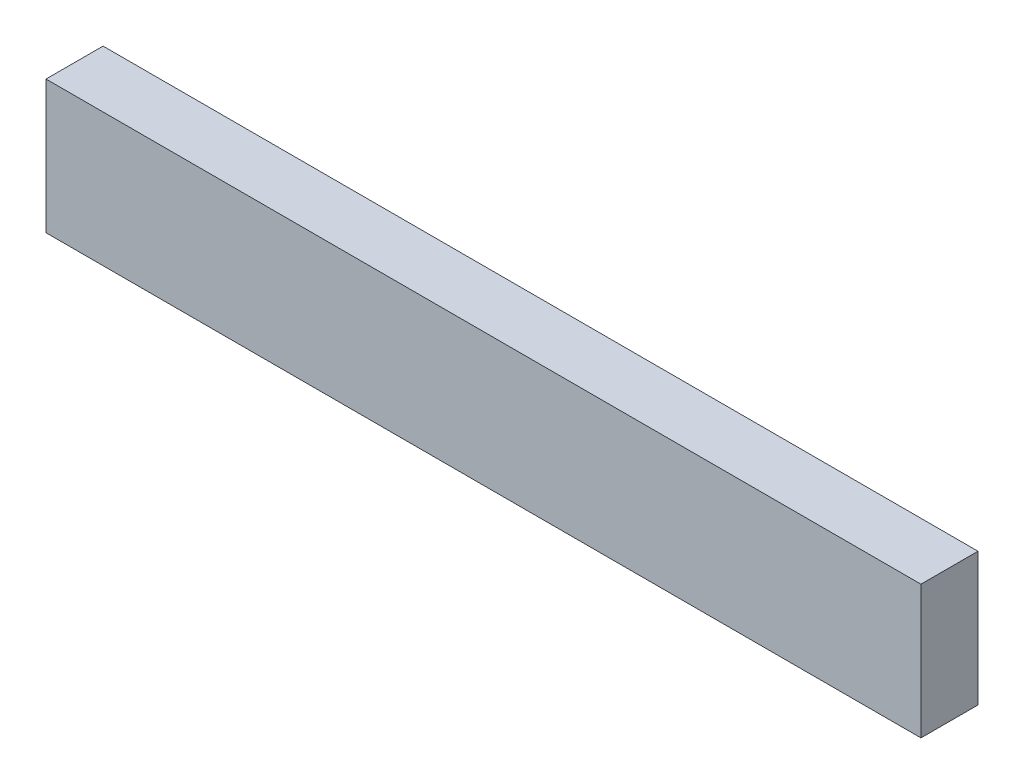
from build123d import *

# Parameters (mm, degrees)
SKETCH1_W           = 38.1
SKETCH1_H           = 88.9
BOSS_EXTRUDE1_DEPTH = 584.2


with BuildPart() as part:
    # Sketch1 → Boss-Extrude1 (new body)
    with BuildSketch(Plane(origin=(0, 0, 0), x_dir=(0, 0, -1), z_dir=(1, 0, 0))):
        Rectangle(SKETCH1_W, SKETCH1_H)
    extrude(amount=BOSS_EXTRUDE1_DEPTH)


solid = part.part
